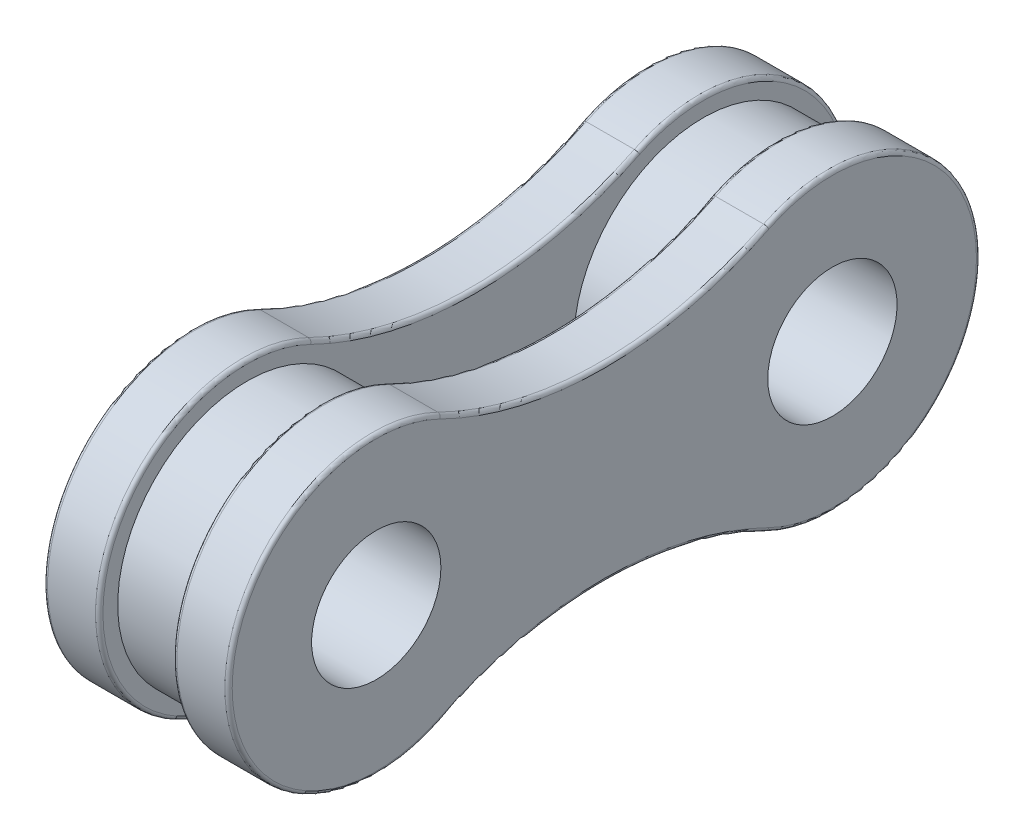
ISO-10303-21;
HEADER;
FILE_DESCRIPTION(('STEP AP214'),'2;1');
FILE_NAME('part.step','',(''),(''),'','','');
FILE_SCHEMA(('AUTOMOTIVE_DESIGN { 1 0 10303 214 1 1 1 1 }'));
ENDSEC;
DATA;
#1=APPLICATION_CONTEXT('core data for automotive mechanical design processes');
#2=APPLICATION_PROTOCOL_DEFINITION('international standard','automotive_design',2000,#1);
#3=PRODUCT_CONTEXT('',#1,'mechanical');
#4=PRODUCT('Part','Part','',(#3));
#5=PRODUCT_RELATED_PRODUCT_CATEGORY('part','',(#4));
#6=PRODUCT_DEFINITION_FORMATION('','',#4);
#7=PRODUCT_DEFINITION_CONTEXT('part definition',#1,'design');
#8=PRODUCT_DEFINITION('design','',#6,#7);
#9=PRODUCT_DEFINITION_SHAPE('','',#8);
#10=(LENGTH_UNIT() NAMED_UNIT(*) SI_UNIT(.MILLI.,.METRE.));
#11=(NAMED_UNIT(*) PLANE_ANGLE_UNIT() SI_UNIT($,.RADIAN.));
#12=(NAMED_UNIT(*) SI_UNIT($,.STERADIAN.) SOLID_ANGLE_UNIT());
#13=UNCERTAINTY_MEASURE_WITH_UNIT(LENGTH_MEASURE(1.E-05),#10,'distance_accuracy_value','');
#14=(GEOMETRIC_REPRESENTATION_CONTEXT(3) GLOBAL_UNCERTAINTY_ASSIGNED_CONTEXT((#13)) GLOBAL_UNIT_ASSIGNED_CONTEXT((#10,
#11,#12)) REPRESENTATION_CONTEXT('',''));
#15=CARTESIAN_POINT('',(0.,0.,0.));
#16=DIRECTION('',(0.,0.,1.));
#17=DIRECTION('',(1.,0.,0.));
#18=AXIS2_PLACEMENT_3D('',#15,#16,#17);
#19=CARTESIAN_POINT('',(1.,6.2823040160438,-3.0875));
#20=DIRECTION('',(1.,0.,0.));
#21=DIRECTION('',(0.,0.,-1.));
#22=AXIS2_PLACEMENT_3D('',#19,#20,#21);
#23=PLANE('',#22);
#24=CARTESIAN_POINT('',(1.,12.5646080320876,0.));
#25=DIRECTION('',(1.,0.,0.));
#26=DIRECTION('',(0.,0.,-1.));
#27=AXIS2_PLACEMENT_3D('',#24,#25,#26);
#28=CIRCLE('',#27,10.1);
#29=CARTESIAN_POINT('',(1.,3.50014080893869,4.45482142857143));
#30=VERTEX_POINT('',#29);
#31=CARTESIAN_POINT('',(1.,3.50014080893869,-4.45482142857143));
#32=VERTEX_POINT('',#31);
#33=EDGE_CURVE('E197',#30,#32,#28,.T.);
#34=ORIENTED_EDGE('',*,*,#33,.T.);
#35=CARTESIAN_POINT('',(1.,0.,-6.175));
#36=DIRECTION('',(1.,0.,0.));
#37=DIRECTION('',(0.,0.,-1.));
#38=AXIS2_PLACEMENT_3D('',#35,#36,#37);
#39=CIRCLE('',#38,3.9);
#40=CARTESIAN_POINT('',(1.,-3.50014080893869,-4.45482142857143));
#41=VERTEX_POINT('',#40);
#42=EDGE_CURVE('E203',#32,#41,#39,.F.);
#43=ORIENTED_EDGE('',*,*,#42,.T.);
#44=CARTESIAN_POINT('',(1.,-12.5646080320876,0.));
#45=DIRECTION('',(1.,0.,0.));
#46=DIRECTION('',(0.,0.,-1.));
#47=AXIS2_PLACEMENT_3D('',#44,#45,#46);
#48=CIRCLE('',#47,10.1);
#49=CARTESIAN_POINT('',(1.,-3.50014080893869,4.45482142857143));
#50=VERTEX_POINT('',#49);
#51=EDGE_CURVE('E201',#41,#50,#48,.T.);
#52=ORIENTED_EDGE('',*,*,#51,.T.);
#53=CARTESIAN_POINT('',(1.,0.,6.175));
#54=DIRECTION('',(1.,0.,0.));
#55=DIRECTION('',(0.,0.,-1.));
#56=AXIS2_PLACEMENT_3D('',#53,#54,#55);
#57=CIRCLE('',#56,3.9);
#58=EDGE_CURVE('E199',#50,#30,#57,.F.);
#59=ORIENTED_EDGE('',*,*,#58,.T.);
#60=EDGE_LOOP('',(#34,#43,#52,#59));
#61=FACE_BOUND('',#60,.T.);
#62=CARTESIAN_POINT('',(1.,0.,6.175));
#63=DIRECTION('',(1.,0.,0.));
#64=DIRECTION('',(0.,0.,-1.));
#65=AXIS2_PLACEMENT_3D('',#62,#63,#64);
#66=CIRCLE('',#65,3.5);
#67=CARTESIAN_POINT('',(1.,0.,2.675));
#68=VERTEX_POINT('',#67);
#69=EDGE_CURVE('E331',#68,#68,#66,.F.);
#70=ORIENTED_EDGE('',*,*,#69,.F.);
#71=EDGE_LOOP('',(#70));
#72=FACE_BOUND('',#71,.T.);
#73=CARTESIAN_POINT('',(1.,0.,-6.175));
#74=DIRECTION('',(1.,0.,0.));
#75=DIRECTION('',(0.,0.,-1.));
#76=AXIS2_PLACEMENT_3D('',#73,#74,#75);
#77=CIRCLE('',#76,3.5);
#78=CARTESIAN_POINT('',(1.,0.,-9.675));
#79=VERTEX_POINT('',#78);
#80=EDGE_CURVE('E174',#79,#79,#77,.F.);
#81=ORIENTED_EDGE('',*,*,#80,.F.);
#82=EDGE_LOOP('',(#81));
#83=FACE_BOUND('',#82,.T.);
#84=ADVANCED_FACE('F37',(#61,#72,#83),#23,.F.);
#85=CARTESIAN_POINT('',(-1.,6.2823040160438,-3.0875));
#86=DIRECTION('',(1.,0.,0.));
#87=DIRECTION('',(0.,0.,-1.));
#88=AXIS2_PLACEMENT_3D('',#85,#86,#87);
#89=PLANE('',#88);
#90=CARTESIAN_POINT('',(-1.,-12.5646080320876,0.));
#91=DIRECTION('',(1.,0.,0.));
#92=DIRECTION('',(0.,0.,-1.));
#93=AXIS2_PLACEMENT_3D('',#90,#91,#92);
#94=CIRCLE('',#93,10.1);
#95=CARTESIAN_POINT('',(-1.,-3.50014080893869,4.45482142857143));
#96=VERTEX_POINT('',#95);
#97=CARTESIAN_POINT('',(-1.,-3.50014080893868,-4.45482142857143));
#98=VERTEX_POINT('',#97);
#99=EDGE_CURVE('E210',#96,#98,#94,.F.);
#100=ORIENTED_EDGE('',*,*,#99,.T.);
#101=CARTESIAN_POINT('',(-1.,0.,-6.175));
#102=DIRECTION('',(1.,0.,0.));
#103=DIRECTION('',(0.,0.,-1.));
#104=AXIS2_PLACEMENT_3D('',#101,#102,#103);
#105=CIRCLE('',#104,3.9);
#106=CARTESIAN_POINT('',(-1.,3.50014080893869,-4.45482142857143));
#107=VERTEX_POINT('',#106);
#108=EDGE_CURVE('E212',#98,#107,#105,.T.);
#109=ORIENTED_EDGE('',*,*,#108,.T.);
#110=CARTESIAN_POINT('',(-1.,12.5646080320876,0.));
#111=DIRECTION('',(1.,0.,0.));
#112=DIRECTION('',(0.,0.,-1.));
#113=AXIS2_PLACEMENT_3D('',#110,#111,#112);
#114=CIRCLE('',#113,10.1);
#115=CARTESIAN_POINT('',(-1.,3.50014080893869,4.45482142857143));
#116=VERTEX_POINT('',#115);
#117=EDGE_CURVE('E206',#107,#116,#114,.F.);
#118=ORIENTED_EDGE('',*,*,#117,.T.);
#119=CARTESIAN_POINT('',(-1.,0.,6.175));
#120=DIRECTION('',(1.,0.,0.));
#121=DIRECTION('',(0.,0.,-1.));
#122=AXIS2_PLACEMENT_3D('',#119,#120,#121);
#123=CIRCLE('',#122,3.9);
#124=EDGE_CURVE('E208',#116,#96,#123,.T.);
#125=ORIENTED_EDGE('',*,*,#124,.T.);
#126=EDGE_LOOP('',(#100,#109,#118,#125));
#127=FACE_BOUND('',#126,.T.);
#128=CARTESIAN_POINT('',(-1.,0.,6.175));
#129=DIRECTION('',(1.,0.,0.));
#130=DIRECTION('',(0.,0.,-1.));
#131=AXIS2_PLACEMENT_3D('',#128,#129,#130);
#132=CIRCLE('',#131,3.5);
#133=CARTESIAN_POINT('',(-1.,0.,2.675));
#134=VERTEX_POINT('',#133);
#135=EDGE_CURVE('E310',#134,#134,#132,.T.);
#136=ORIENTED_EDGE('',*,*,#135,.F.);
#137=EDGE_LOOP('',(#136));
#138=FACE_BOUND('',#137,.T.);
#139=CARTESIAN_POINT('',(-1.,0.,-6.175));
#140=DIRECTION('',(1.,0.,0.));
#141=DIRECTION('',(0.,0.,-1.));
#142=AXIS2_PLACEMENT_3D('',#139,#140,#141);
#143=CIRCLE('',#142,3.5);
#144=CARTESIAN_POINT('',(-1.,0.,-9.675));
#145=VERTEX_POINT('',#144);
#146=EDGE_CURVE('E246',#145,#145,#143,.T.);
#147=ORIENTED_EDGE('',*,*,#146,.F.);
#148=EDGE_LOOP('',(#147));
#149=FACE_BOUND('',#148,.T.);
#150=ADVANCED_FACE('F377',(#127,#138,#149),#89,.T.);
#151=CARTESIAN_POINT('',(2.5,6.2823040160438,-3.0875));
#152=DIRECTION('',(1.,0.,0.));
#153=DIRECTION('',(0.,0.,-1.));
#154=AXIS2_PLACEMENT_3D('',#151,#152,#153);
#155=PLANE('',#154);
#156=CARTESIAN_POINT('',(2.5,-12.5646080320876,0.));
#157=DIRECTION('',(1.,0.,0.));
#158=DIRECTION('',(0.,0.,-1.));
#159=AXIS2_PLACEMENT_3D('',#156,#157,#158);
#160=CIRCLE('',#159,10.1);
#161=CARTESIAN_POINT('',(2.5,-3.50014080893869,4.45482142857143));
#162=VERTEX_POINT('',#161);
#163=CARTESIAN_POINT('',(2.5,-3.50014080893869,-4.45482142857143));
#164=VERTEX_POINT('',#163);
#165=EDGE_CURVE('E179',#162,#164,#160,.F.);
#166=ORIENTED_EDGE('',*,*,#165,.T.);
#167=CARTESIAN_POINT('',(2.5,0.,-6.175));
#168=DIRECTION('',(1.,0.,0.));
#169=DIRECTION('',(0.,0.,-1.));
#170=AXIS2_PLACEMENT_3D('',#167,#168,#169);
#171=CIRCLE('',#170,3.9);
#172=CARTESIAN_POINT('',(2.5,3.50014080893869,-4.45482142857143));
#173=VERTEX_POINT('',#172);
#174=EDGE_CURVE('E158',#164,#173,#171,.T.);
#175=ORIENTED_EDGE('',*,*,#174,.T.);
#176=CARTESIAN_POINT('',(2.5,12.5646080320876,0.));
#177=DIRECTION('',(1.,0.,0.));
#178=DIRECTION('',(0.,0.,-1.));
#179=AXIS2_PLACEMENT_3D('',#176,#177,#178);
#180=CIRCLE('',#179,10.1);
#181=CARTESIAN_POINT('',(2.5,3.50014080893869,4.45482142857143));
#182=VERTEX_POINT('',#181);
#183=EDGE_CURVE('E167',#173,#182,#180,.F.);
#184=ORIENTED_EDGE('',*,*,#183,.T.);
#185=CARTESIAN_POINT('',(2.5,0.,6.175));
#186=DIRECTION('',(1.,0.,0.));
#187=DIRECTION('',(0.,0.,-1.));
#188=AXIS2_PLACEMENT_3D('',#185,#186,#187);
#189=CIRCLE('',#188,3.9);
#190=EDGE_CURVE('E173',#182,#162,#189,.T.);
#191=ORIENTED_EDGE('',*,*,#190,.T.);
#192=EDGE_LOOP('',(#166,#175,#184,#191));
#193=FACE_BOUND('',#192,.T.);
#194=CARTESIAN_POINT('',(2.5,0.,6.175));
#195=DIRECTION('',(1.,0.,0.));
#196=DIRECTION('',(0.,0.,-1.));
#197=AXIS2_PLACEMENT_3D('',#194,#195,#196);
#198=CIRCLE('',#197,1.75);
#199=CARTESIAN_POINT('',(2.5,0.,4.425));
#200=VERTEX_POINT('',#199);
#201=EDGE_CURVE('E316',#200,#200,#198,.T.);
#202=ORIENTED_EDGE('',*,*,#201,.F.);
#203=EDGE_LOOP('',(#202));
#204=FACE_BOUND('',#203,.T.);
#205=CARTESIAN_POINT('',(2.5,0.,-6.175));
#206=DIRECTION('',(1.,0.,0.));
#207=DIRECTION('',(0.,0.,1.));
#208=AXIS2_PLACEMENT_3D('',#205,#206,#207);
#209=CIRCLE('',#208,1.75);
#210=CARTESIAN_POINT('',(2.5,0.,-4.425));
#211=VERTEX_POINT('',#210);
#212=EDGE_CURVE('E313',#211,#211,#209,.T.);
#213=ORIENTED_EDGE('',*,*,#212,.F.);
#214=EDGE_LOOP('',(#213));
#215=FACE_BOUND('',#214,.T.);
#216=ADVANCED_FACE('F176',(#193,#204,#215),#155,.T.);
#217=CARTESIAN_POINT('',(2.5,12.5646080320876,0.));
#218=DIRECTION('',(-1.,0.,0.));
#219=DIRECTION('',(0.,0.,1.));
#220=AXIS2_PLACEMENT_3D('',#217,#218,#219);
#221=CYLINDRICAL_SURFACE('',#220,10.);
#222=DIRECTION('',(-1.,0.,0.));
#223=VECTOR('',#222,1.);
#224=CARTESIAN_POINT('',(2.5,3.58988800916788,4.41071428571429));
#225=LINE('',#224,#223);
#226=CARTESIAN_POINT('',(2.4,3.58988800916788,4.41071428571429));
#227=VERTEX_POINT('',#226);
#228=CARTESIAN_POINT('',(1.1,3.58988800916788,4.41071428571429));
#229=VERTEX_POINT('',#228);
#230=EDGE_CURVE('E328',#227,#229,#225,.T.);
#231=ORIENTED_EDGE('',*,*,#230,.F.);
#232=CARTESIAN_POINT('',(2.4,12.5646080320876,0.));
#233=DIRECTION('',(1.,0.,0.));
#234=DIRECTION('',(0.,0.,-1.));
#235=AXIS2_PLACEMENT_3D('',#232,#233,#234);
#236=CIRCLE('',#235,10.);
#237=CARTESIAN_POINT('',(2.4,3.58988800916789,-4.41071428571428));
#238=VERTEX_POINT('',#237);
#239=EDGE_CURVE('E238',#227,#238,#236,.T.);
#240=ORIENTED_EDGE('',*,*,#239,.T.);
#241=DIRECTION('',(-1.,0.,0.));
#242=VECTOR('',#241,1.);
#243=CARTESIAN_POINT('',(2.5,3.58988800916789,-4.41071428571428));
#244=LINE('',#243,#242);
#245=CARTESIAN_POINT('',(1.1,3.58988800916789,-4.41071428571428));
#246=VERTEX_POINT('',#245);
#247=EDGE_CURVE('E319',#238,#246,#244,.T.);
#248=ORIENTED_EDGE('',*,*,#247,.T.);
#249=CARTESIAN_POINT('',(1.1,12.5646080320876,0.));
#250=DIRECTION('',(1.,0.,0.));
#251=DIRECTION('',(0.,0.,-1.));
#252=AXIS2_PLACEMENT_3D('',#249,#250,#251);
#253=CIRCLE('',#252,10.);
#254=EDGE_CURVE('E236',#246,#229,#253,.F.);
#255=ORIENTED_EDGE('',*,*,#254,.T.);
#256=EDGE_LOOP('',(#231,#240,#248,#255));
#257=FACE_BOUND('',#256,.T.);
#258=ADVANCED_FACE('F363',(#257),#221,.F.);
#259=CARTESIAN_POINT('',(2.5,0.,6.175));
#260=DIRECTION('',(-1.,0.,0.));
#261=DIRECTION('',(0.,0.,1.));
#262=AXIS2_PLACEMENT_3D('',#259,#260,#261);
#263=CYLINDRICAL_SURFACE('',#262,4.);
#264=DIRECTION('',(-1.,0.,0.));
#265=VECTOR('',#264,1.);
#266=CARTESIAN_POINT('',(2.5,-3.58988800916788,4.41071428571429));
#267=LINE('',#266,#265);
#268=CARTESIAN_POINT('',(2.4,-3.58988800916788,4.41071428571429));
#269=VERTEX_POINT('',#268);
#270=CARTESIAN_POINT('',(1.1,-3.58988800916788,4.41071428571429));
#271=VERTEX_POINT('',#270);
#272=EDGE_CURVE('E325',#269,#271,#267,.T.);
#273=ORIENTED_EDGE('',*,*,#272,.F.);
#274=CARTESIAN_POINT('',(2.4,0.,6.175));
#275=DIRECTION('',(1.,0.,0.));
#276=DIRECTION('',(0.,0.,-1.));
#277=AXIS2_PLACEMENT_3D('',#274,#275,#276);
#278=CIRCLE('',#277,4.);
#279=EDGE_CURVE('E195',#269,#227,#278,.F.);
#280=ORIENTED_EDGE('',*,*,#279,.T.);
#281=ORIENTED_EDGE('',*,*,#230,.T.);
#282=CARTESIAN_POINT('',(1.1,0.,6.175));
#283=DIRECTION('',(1.,0.,0.));
#284=DIRECTION('',(0.,0.,-1.));
#285=AXIS2_PLACEMENT_3D('',#282,#283,#284);
#286=CIRCLE('',#285,4.);
#287=EDGE_CURVE('E193',#229,#271,#286,.T.);
#288=ORIENTED_EDGE('',*,*,#287,.T.);
#289=EDGE_LOOP('',(#273,#280,#281,#288));
#290=FACE_BOUND('',#289,.T.);
#291=ADVANCED_FACE('F366',(#290),#263,.T.);
#292=CARTESIAN_POINT('',(2.5,-12.5646080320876,0.));
#293=DIRECTION('',(-1.,0.,0.));
#294=DIRECTION('',(0.,0.,1.));
#295=AXIS2_PLACEMENT_3D('',#292,#293,#294);
#296=CYLINDRICAL_SURFACE('',#295,10.);
#297=DIRECTION('',(-1.,0.,0.));
#298=VECTOR('',#297,1.);
#299=CARTESIAN_POINT('',(2.5,-3.58988800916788,-4.41071428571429));
#300=LINE('',#299,#298);
#301=CARTESIAN_POINT('',(2.4,-3.58988800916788,-4.41071428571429));
#302=VERTEX_POINT('',#301);
#303=CARTESIAN_POINT('',(1.1,-3.58988800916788,-4.41071428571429));
#304=VERTEX_POINT('',#303);
#305=EDGE_CURVE('E322',#302,#304,#300,.T.);
#306=ORIENTED_EDGE('',*,*,#305,.F.);
#307=CARTESIAN_POINT('',(2.4,-12.5646080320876,0.));
#308=DIRECTION('',(1.,0.,0.));
#309=DIRECTION('',(0.,0.,-1.));
#310=AXIS2_PLACEMENT_3D('',#307,#308,#309);
#311=CIRCLE('',#310,10.);
#312=EDGE_CURVE('E191',#302,#269,#311,.T.);
#313=ORIENTED_EDGE('',*,*,#312,.T.);
#314=ORIENTED_EDGE('',*,*,#272,.T.);
#315=CARTESIAN_POINT('',(1.1,-12.5646080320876,0.));
#316=DIRECTION('',(1.,0.,0.));
#317=DIRECTION('',(0.,0.,-1.));
#318=AXIS2_PLACEMENT_3D('',#315,#316,#317);
#319=CIRCLE('',#318,10.);
#320=EDGE_CURVE('E189',#271,#304,#319,.F.);
#321=ORIENTED_EDGE('',*,*,#320,.T.);
#322=EDGE_LOOP('',(#306,#313,#314,#321));
#323=FACE_BOUND('',#322,.T.);
#324=ADVANCED_FACE('F349',(#323),#296,.F.);
#325=CARTESIAN_POINT('',(2.5,0.,-6.175));
#326=DIRECTION('',(-1.,0.,0.));
#327=DIRECTION('',(0.,0.,1.));
#328=AXIS2_PLACEMENT_3D('',#325,#326,#327);
#329=CYLINDRICAL_SURFACE('',#328,4.);
#330=ORIENTED_EDGE('',*,*,#247,.F.);
#331=CARTESIAN_POINT('',(2.4,0.,-6.175));
#332=DIRECTION('',(1.,0.,0.));
#333=DIRECTION('',(0.,0.,-1.));
#334=AXIS2_PLACEMENT_3D('',#331,#332,#333);
#335=CIRCLE('',#334,4.);
#336=EDGE_CURVE('E160',#238,#302,#335,.F.);
#337=ORIENTED_EDGE('',*,*,#336,.T.);
#338=ORIENTED_EDGE('',*,*,#305,.T.);
#339=CARTESIAN_POINT('',(1.1,0.,-6.175));
#340=DIRECTION('',(1.,0.,0.));
#341=DIRECTION('',(0.,0.,-1.));
#342=AXIS2_PLACEMENT_3D('',#339,#340,#341);
#343=CIRCLE('',#342,4.);
#344=EDGE_CURVE('E181',#304,#246,#343,.T.);
#345=ORIENTED_EDGE('',*,*,#344,.T.);
#346=EDGE_LOOP('',(#330,#337,#338,#345));
#347=FACE_BOUND('',#346,.T.);
#348=ADVANCED_FACE('F347',(#347),#329,.T.);
#349=CARTESIAN_POINT('',(2.5,0.,6.175));
#350=DIRECTION('',(-1.,0.,0.));
#351=DIRECTION('',(0.,0.,1.));
#352=AXIS2_PLACEMENT_3D('',#349,#350,#351);
#353=CYLINDRICAL_SURFACE('',#352,1.75);
#354=ORIENTED_EDGE('',*,*,#201,.T.);
#355=EDGE_LOOP('',(#354));
#356=FACE_BOUND('',#355,.T.);
#357=CARTESIAN_POINT('',(-2.5,0.,6.175));
#358=DIRECTION('',(1.,0.,0.));
#359=DIRECTION('',(0.,0.,-1.));
#360=AXIS2_PLACEMENT_3D('',#357,#358,#359);
#361=CIRCLE('',#360,1.75);
#362=CARTESIAN_POINT('',(-2.5,0.,4.425));
#363=VERTEX_POINT('',#362);
#364=EDGE_CURVE('E306',#363,#363,#361,.T.);
#365=ORIENTED_EDGE('',*,*,#364,.F.);
#366=EDGE_LOOP('',(#365));
#367=FACE_BOUND('',#366,.T.);
#368=ADVANCED_FACE('F440',(#356,#367),#353,.F.);
#369=CARTESIAN_POINT('',(2.5,0.,-6.175));
#370=DIRECTION('',(-1.,0.,0.));
#371=DIRECTION('',(0.,0.,1.));
#372=AXIS2_PLACEMENT_3D('',#369,#370,#371);
#373=CYLINDRICAL_SURFACE('',#372,1.75);
#374=ORIENTED_EDGE('',*,*,#212,.T.);
#375=EDGE_LOOP('',(#374));
#376=FACE_BOUND('',#375,.T.);
#377=CARTESIAN_POINT('',(-2.5,0.,-6.175));
#378=DIRECTION('',(1.,0.,0.));
#379=DIRECTION('',(0.,0.,-1.));
#380=AXIS2_PLACEMENT_3D('',#377,#378,#379);
#381=CIRCLE('',#380,1.75);
#382=CARTESIAN_POINT('',(-2.5,0.,-7.925));
#383=VERTEX_POINT('',#382);
#384=EDGE_CURVE('E301',#383,#383,#381,.T.);
#385=ORIENTED_EDGE('',*,*,#384,.F.);
#386=EDGE_LOOP('',(#385));
#387=FACE_BOUND('',#386,.T.);
#388=ADVANCED_FACE('F436',(#376,#387),#373,.F.);
#389=CARTESIAN_POINT('',(1.,0.,6.175));
#390=DIRECTION('',(-1.,0.,0.));
#391=DIRECTION('',(0.,0.,1.));
#392=AXIS2_PLACEMENT_3D('',#389,#390,#391);
#393=CYLINDRICAL_SURFACE('',#392,3.5);
#394=ORIENTED_EDGE('',*,*,#69,.T.);
#395=EDGE_LOOP('',(#394));
#396=FACE_BOUND('',#395,.T.);
#397=ORIENTED_EDGE('',*,*,#135,.T.);
#398=EDGE_LOOP('',(#397));
#399=FACE_BOUND('',#398,.T.);
#400=ADVANCED_FACE('F427',(#396,#399),#393,.T.);
#401=CARTESIAN_POINT('',(-2.5,0.,-6.175));
#402=DIRECTION('',(1.,0.,0.));
#403=DIRECTION('',(0.,0.,-1.));
#404=AXIS2_PLACEMENT_3D('',#401,#402,#403);
#405=CYLINDRICAL_SURFACE('',#404,4.);
#406=DIRECTION('',(1.,0.,0.));
#407=VECTOR('',#406,1.);
#408=CARTESIAN_POINT('',(-2.5,3.58988800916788,-4.41071428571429));
#409=LINE('',#408,#407);
#410=CARTESIAN_POINT('',(-2.4,3.58988800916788,-4.41071428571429));
#411=VERTEX_POINT('',#410);
#412=CARTESIAN_POINT('',(-1.1,3.58988800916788,-4.41071428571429));
#413=VERTEX_POINT('',#412);
#414=EDGE_CURVE('E294',#411,#413,#409,.T.);
#415=ORIENTED_EDGE('',*,*,#414,.T.);
#416=CARTESIAN_POINT('',(-1.1,0.,-6.175));
#417=DIRECTION('',(1.,0.,0.));
#418=DIRECTION('',(0.,0.,-1.));
#419=AXIS2_PLACEMENT_3D('',#416,#417,#418);
#420=CIRCLE('',#419,4.);
#421=CARTESIAN_POINT('',(-1.1,-3.58988800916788,-4.41071428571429));
#422=VERTEX_POINT('',#421);
#423=EDGE_CURVE('E218',#413,#422,#420,.F.);
#424=ORIENTED_EDGE('',*,*,#423,.T.);
#425=DIRECTION('',(1.,0.,0.));
#426=VECTOR('',#425,1.);
#427=CARTESIAN_POINT('',(-2.5,-3.58988800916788,-4.41071428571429));
#428=LINE('',#427,#426);
#429=CARTESIAN_POINT('',(-2.4,-3.58988800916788,-4.41071428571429));
#430=VERTEX_POINT('',#429);
#431=EDGE_CURVE('E297',#430,#422,#428,.T.);
#432=ORIENTED_EDGE('',*,*,#431,.F.);
#433=CARTESIAN_POINT('',(-2.4,0.,-6.175));
#434=DIRECTION('',(1.,0.,0.));
#435=DIRECTION('',(0.,0.,-1.));
#436=AXIS2_PLACEMENT_3D('',#433,#434,#435);
#437=CIRCLE('',#436,4.);
#438=EDGE_CURVE('E215',#430,#411,#437,.T.);
#439=ORIENTED_EDGE('',*,*,#438,.T.);
#440=EDGE_LOOP('',(#415,#424,#432,#439));
#441=FACE_BOUND('',#440,.T.);
#442=ADVANCED_FACE('F293',(#441),#405,.T.);
#443=CARTESIAN_POINT('',(-2.5,-12.5646080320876,0.));
#444=DIRECTION('',(1.,0.,0.));
#445=DIRECTION('',(0.,0.,-1.));
#446=AXIS2_PLACEMENT_3D('',#443,#444,#445);
#447=CYLINDRICAL_SURFACE('',#446,10.);
#448=ORIENTED_EDGE('',*,*,#431,.T.);
#449=CARTESIAN_POINT('',(-1.1,-12.5646080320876,0.));
#450=DIRECTION('',(1.,0.,0.));
#451=DIRECTION('',(0.,0.,-1.));
#452=AXIS2_PLACEMENT_3D('',#449,#450,#451);
#453=CIRCLE('',#452,10.);
#454=CARTESIAN_POINT('',(-1.1,-3.58988800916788,4.41071428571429));
#455=VERTEX_POINT('',#454);
#456=EDGE_CURVE('E223',#422,#455,#453,.T.);
#457=ORIENTED_EDGE('',*,*,#456,.T.);
#458=DIRECTION('',(1.,0.,0.));
#459=VECTOR('',#458,1.);
#460=CARTESIAN_POINT('',(-2.5,-3.58988800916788,4.41071428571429));
#461=LINE('',#460,#459);
#462=CARTESIAN_POINT('',(-2.4,-3.58988800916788,4.41071428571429));
#463=VERTEX_POINT('',#462);
#464=EDGE_CURVE('E303',#463,#455,#461,.T.);
#465=ORIENTED_EDGE('',*,*,#464,.F.);
#466=CARTESIAN_POINT('',(-2.4,-12.5646080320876,0.));
#467=DIRECTION('',(1.,0.,0.));
#468=DIRECTION('',(0.,0.,-1.));
#469=AXIS2_PLACEMENT_3D('',#466,#467,#468);
#470=CIRCLE('',#469,10.);
#471=EDGE_CURVE('E221',#463,#430,#470,.F.);
#472=ORIENTED_EDGE('',*,*,#471,.T.);
#473=EDGE_LOOP('',(#448,#457,#465,#472));
#474=FACE_BOUND('',#473,.T.);
#475=ADVANCED_FACE('F419',(#474),#447,.F.);
#476=CARTESIAN_POINT('',(-2.5,0.,6.175));
#477=DIRECTION('',(1.,0.,0.));
#478=DIRECTION('',(0.,0.,-1.));
#479=AXIS2_PLACEMENT_3D('',#476,#477,#478);
#480=CYLINDRICAL_SURFACE('',#479,4.);
#481=ORIENTED_EDGE('',*,*,#464,.T.);
#482=CARTESIAN_POINT('',(-1.1,0.,6.175));
#483=DIRECTION('',(1.,0.,0.));
#484=DIRECTION('',(0.,0.,-1.));
#485=AXIS2_PLACEMENT_3D('',#482,#483,#484);
#486=CIRCLE('',#485,4.);
#487=CARTESIAN_POINT('',(-1.1,3.58988800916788,4.41071428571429));
#488=VERTEX_POINT('',#487);
#489=EDGE_CURVE('E227',#455,#488,#486,.F.);
#490=ORIENTED_EDGE('',*,*,#489,.T.);
#491=DIRECTION('',(1.,0.,0.));
#492=VECTOR('',#491,1.);
#493=CARTESIAN_POINT('',(-2.5,3.58988800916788,4.41071428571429));
#494=LINE('',#493,#492);
#495=CARTESIAN_POINT('',(-2.4,3.58988800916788,4.41071428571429));
#496=VERTEX_POINT('',#495);
#497=EDGE_CURVE('E300',#496,#488,#494,.T.);
#498=ORIENTED_EDGE('',*,*,#497,.F.);
#499=CARTESIAN_POINT('',(-2.4,0.,6.175));
#500=DIRECTION('',(1.,0.,0.));
#501=DIRECTION('',(0.,0.,-1.));
#502=AXIS2_PLACEMENT_3D('',#499,#500,#501);
#503=CIRCLE('',#502,4.);
#504=EDGE_CURVE('E225',#496,#463,#503,.T.);
#505=ORIENTED_EDGE('',*,*,#504,.T.);
#506=EDGE_LOOP('',(#481,#490,#498,#505));
#507=FACE_BOUND('',#506,.T.);
#508=ADVANCED_FACE('F398',(#507),#480,.T.);
#509=CARTESIAN_POINT('',(-2.5,12.5646080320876,0.));
#510=DIRECTION('',(1.,0.,0.));
#511=DIRECTION('',(0.,0.,-1.));
#512=AXIS2_PLACEMENT_3D('',#509,#510,#511);
#513=CYLINDRICAL_SURFACE('',#512,10.);
#514=ORIENTED_EDGE('',*,*,#497,.T.);
#515=CARTESIAN_POINT('',(-1.1,12.5646080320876,0.));
#516=DIRECTION('',(1.,0.,0.));
#517=DIRECTION('',(0.,0.,-1.));
#518=AXIS2_PLACEMENT_3D('',#515,#516,#517);
#519=CIRCLE('',#518,10.);
#520=EDGE_CURVE('E11',#488,#413,#519,.T.);
#521=ORIENTED_EDGE('',*,*,#520,.T.);
#522=ORIENTED_EDGE('',*,*,#414,.F.);
#523=CARTESIAN_POINT('',(-2.4,12.5646080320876,0.));
#524=DIRECTION('',(1.,0.,0.));
#525=DIRECTION('',(0.,0.,-1.));
#526=AXIS2_PLACEMENT_3D('',#523,#524,#525);
#527=CIRCLE('',#526,10.);
#528=EDGE_CURVE('E46',#411,#496,#527,.F.);
#529=ORIENTED_EDGE('',*,*,#528,.T.);
#530=EDGE_LOOP('',(#514,#521,#522,#529));
#531=FACE_BOUND('',#530,.T.);
#532=ADVANCED_FACE('F298',(#531),#513,.F.);
#533=CARTESIAN_POINT('',(-2.5,6.2823040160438,-3.0875));
#534=DIRECTION('',(1.,0.,0.));
#535=DIRECTION('',(0.,0.,-1.));
#536=AXIS2_PLACEMENT_3D('',#533,#534,#535);
#537=PLANE('',#536);
#538=CARTESIAN_POINT('',(-2.5,12.5646080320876,0.));
#539=DIRECTION('',(1.,0.,0.));
#540=DIRECTION('',(0.,0.,-1.));
#541=AXIS2_PLACEMENT_3D('',#538,#539,#540);
#542=CIRCLE('',#541,10.1);
#543=CARTESIAN_POINT('',(-2.5,3.50014080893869,4.45482142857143));
#544=VERTEX_POINT('',#543);
#545=CARTESIAN_POINT('',(-2.5,3.50014080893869,-4.45482142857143));
#546=VERTEX_POINT('',#545);
#547=EDGE_CURVE('E229',#544,#546,#542,.T.);
#548=ORIENTED_EDGE('',*,*,#547,.T.);
#549=CARTESIAN_POINT('',(-2.5,0.,-6.175));
#550=DIRECTION('',(1.,0.,0.));
#551=DIRECTION('',(0.,0.,-1.));
#552=AXIS2_PLACEMENT_3D('',#549,#550,#551);
#553=CIRCLE('',#552,3.9);
#554=CARTESIAN_POINT('',(-2.5,-3.50014080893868,-4.45482142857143));
#555=VERTEX_POINT('',#554);
#556=EDGE_CURVE('E234',#546,#555,#553,.F.);
#557=ORIENTED_EDGE('',*,*,#556,.T.);
#558=CARTESIAN_POINT('',(-2.5,-12.5646080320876,0.));
#559=DIRECTION('',(1.,0.,0.));
#560=DIRECTION('',(0.,0.,-1.));
#561=AXIS2_PLACEMENT_3D('',#558,#559,#560);
#562=CIRCLE('',#561,10.1);
#563=CARTESIAN_POINT('',(-2.5,-3.50014080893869,4.45482142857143));
#564=VERTEX_POINT('',#563);
#565=EDGE_CURVE('E61',#555,#564,#562,.T.);
#566=ORIENTED_EDGE('',*,*,#565,.T.);
#567=CARTESIAN_POINT('',(-2.5,0.,6.175));
#568=DIRECTION('',(1.,0.,0.));
#569=DIRECTION('',(0.,0.,-1.));
#570=AXIS2_PLACEMENT_3D('',#567,#568,#569);
#571=CIRCLE('',#570,3.9);
#572=EDGE_CURVE('E231',#564,#544,#571,.F.);
#573=ORIENTED_EDGE('',*,*,#572,.T.);
#574=EDGE_LOOP('',(#548,#557,#566,#573));
#575=FACE_BOUND('',#574,.T.);
#576=ORIENTED_EDGE('',*,*,#364,.T.);
#577=EDGE_LOOP('',(#576));
#578=FACE_BOUND('',#577,.T.);
#579=ORIENTED_EDGE('',*,*,#384,.T.);
#580=EDGE_LOOP('',(#579));
#581=FACE_BOUND('',#580,.T.);
#582=ADVANCED_FACE('F281',(#575,#578,#581),#537,.F.);
#583=CARTESIAN_POINT('',(1.,0.,-6.175));
#584=DIRECTION('',(-1.,0.,0.));
#585=DIRECTION('',(0.,0.,1.));
#586=AXIS2_PLACEMENT_3D('',#583,#584,#585);
#587=CYLINDRICAL_SURFACE('',#586,3.5);
#588=ORIENTED_EDGE('',*,*,#80,.T.);
#589=EDGE_LOOP('',(#588));
#590=FACE_BOUND('',#589,.T.);
#591=ORIENTED_EDGE('',*,*,#146,.T.);
#592=EDGE_LOOP('',(#591));
#593=FACE_BOUND('',#592,.T.);
#594=ADVANCED_FACE('F383',(#590,#593),#587,.T.);
#595=CARTESIAN_POINT('',(2.4,0.,6.175));
#596=DIRECTION('',(1.,0.,0.));
#597=DIRECTION('',(0.,0.,-1.));
#598=AXIS2_PLACEMENT_3D('',#595,#596,#597);
#599=TOROIDAL_SURFACE('',#598,3.9,0.1);
#600=CARTESIAN_POINT('',(2.4,3.50014080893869,4.45482142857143));
#601=DIRECTION('',(0.,-0.441071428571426,-0.897472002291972));
#602=DIRECTION('',(0.,0.897472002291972,-0.441071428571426));
#603=AXIS2_PLACEMENT_3D('',#600,#601,#602);
#604=CIRCLE('',#603,0.1);
#605=EDGE_CURVE('E170',#227,#182,#604,.T.);
#606=ORIENTED_EDGE('',*,*,#605,.F.);
#607=ORIENTED_EDGE('',*,*,#279,.F.);
#608=CARTESIAN_POINT('',(2.4,-3.50014080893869,4.45482142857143));
#609=DIRECTION('',(0.,0.441071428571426,-0.897472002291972));
#610=DIRECTION('',(0.,0.897472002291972,0.441071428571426));
#611=AXIS2_PLACEMENT_3D('',#608,#609,#610);
#612=CIRCLE('',#611,0.1);
#613=EDGE_CURVE('E243',#162,#269,#612,.T.);
#614=ORIENTED_EDGE('',*,*,#613,.F.);
#615=ORIENTED_EDGE('',*,*,#190,.F.);
#616=EDGE_LOOP('',(#606,#607,#614,#615));
#617=FACE_BOUND('',#616,.T.);
#618=ADVANCED_FACE('F338',(#617),#599,.T.);
#619=CARTESIAN_POINT('',(2.4,-12.5646080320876,0.));
#620=DIRECTION('',(1.,0.,0.));
#621=DIRECTION('',(0.,0.,-1.));
#622=AXIS2_PLACEMENT_3D('',#619,#620,#621);
#623=TOROIDAL_SURFACE('',#622,10.1,0.1);
#624=ORIENTED_EDGE('',*,*,#613,.T.);
#625=ORIENTED_EDGE('',*,*,#312,.F.);
#626=CARTESIAN_POINT('',(2.4,-3.50014080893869,-4.45482142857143));
#627=DIRECTION('',(0.,-0.441071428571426,-0.897472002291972));
#628=DIRECTION('',(0.,0.897472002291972,-0.441071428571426));
#629=AXIS2_PLACEMENT_3D('',#626,#627,#628);
#630=CIRCLE('',#629,0.1);
#631=EDGE_CURVE('E163',#164,#302,#630,.T.);
#632=ORIENTED_EDGE('',*,*,#631,.F.);
#633=ORIENTED_EDGE('',*,*,#165,.F.);
#634=EDGE_LOOP('',(#624,#625,#632,#633));
#635=FACE_BOUND('',#634,.T.);
#636=ADVANCED_FACE('F341',(#635),#623,.T.);
#637=CARTESIAN_POINT('',(2.4,12.5646080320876,0.));
#638=DIRECTION('',(1.,0.,0.));
#639=DIRECTION('',(0.,0.,-1.));
#640=AXIS2_PLACEMENT_3D('',#637,#638,#639);
#641=TOROIDAL_SURFACE('',#640,10.1,0.1);
#642=ORIENTED_EDGE('',*,*,#605,.T.);
#643=ORIENTED_EDGE('',*,*,#183,.F.);
#644=CARTESIAN_POINT('',(2.4,3.50014080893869,-4.45482142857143));
#645=DIRECTION('',(0.,0.441071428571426,-0.897472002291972));
#646=DIRECTION('',(0.,0.897472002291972,0.441071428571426));
#647=AXIS2_PLACEMENT_3D('',#644,#645,#646);
#648=CIRCLE('',#647,0.1);
#649=EDGE_CURVE('E154',#238,#173,#648,.T.);
#650=ORIENTED_EDGE('',*,*,#649,.F.);
#651=ORIENTED_EDGE('',*,*,#239,.F.);
#652=EDGE_LOOP('',(#642,#643,#650,#651));
#653=FACE_BOUND('',#652,.T.);
#654=ADVANCED_FACE('F168',(#653),#641,.T.);
#655=CARTESIAN_POINT('',(2.4,0.,-6.175));
#656=DIRECTION('',(1.,0.,0.));
#657=DIRECTION('',(0.,0.,-1.));
#658=AXIS2_PLACEMENT_3D('',#655,#656,#657);
#659=TOROIDAL_SURFACE('',#658,3.9,0.1);
#660=ORIENTED_EDGE('',*,*,#631,.T.);
#661=ORIENTED_EDGE('',*,*,#336,.F.);
#662=ORIENTED_EDGE('',*,*,#649,.T.);
#663=ORIENTED_EDGE('',*,*,#174,.F.);
#664=EDGE_LOOP('',(#660,#661,#662,#663));
#665=FACE_BOUND('',#664,.T.);
#666=ADVANCED_FACE('F156',(#665),#659,.T.);
#667=CARTESIAN_POINT('',(1.1,0.,6.175));
#668=DIRECTION('',(1.,0.,0.));
#669=DIRECTION('',(0.,0.,-1.));
#670=AXIS2_PLACEMENT_3D('',#667,#668,#669);
#671=TOROIDAL_SURFACE('',#670,3.9,0.1);
#672=CARTESIAN_POINT('',(1.1,3.50014080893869,4.45482142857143));
#673=DIRECTION('',(0.,-0.441071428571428,-0.897472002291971));
#674=DIRECTION('',(0.,0.897472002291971,-0.441071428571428));
#675=AXIS2_PLACEMENT_3D('',#672,#673,#674);
#676=CIRCLE('',#675,0.1);
#677=EDGE_CURVE('E252',#30,#229,#676,.T.);
#678=ORIENTED_EDGE('',*,*,#677,.F.);
#679=ORIENTED_EDGE('',*,*,#58,.F.);
#680=CARTESIAN_POINT('',(1.1,-3.50014080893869,4.45482142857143));
#681=DIRECTION('',(0.,0.441071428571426,-0.897472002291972));
#682=DIRECTION('',(0.,0.897472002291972,0.441071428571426));
#683=AXIS2_PLACEMENT_3D('',#680,#681,#682);
#684=CIRCLE('',#683,0.1);
#685=EDGE_CURVE('E164',#271,#50,#684,.T.);
#686=ORIENTED_EDGE('',*,*,#685,.F.);
#687=ORIENTED_EDGE('',*,*,#287,.F.);
#688=EDGE_LOOP('',(#678,#679,#686,#687));
#689=FACE_BOUND('',#688,.T.);
#690=ADVANCED_FACE('F369',(#689),#671,.T.);
#691=CARTESIAN_POINT('',(1.1,-12.5646080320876,0.));
#692=DIRECTION('',(1.,0.,0.));
#693=DIRECTION('',(0.,0.,-1.));
#694=AXIS2_PLACEMENT_3D('',#691,#692,#693);
#695=TOROIDAL_SURFACE('',#694,10.1,0.1);
#696=ORIENTED_EDGE('',*,*,#685,.T.);
#697=ORIENTED_EDGE('',*,*,#51,.F.);
#698=CARTESIAN_POINT('',(1.1,-3.50014080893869,-4.45482142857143));
#699=DIRECTION('',(0.,-0.441071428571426,-0.897472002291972));
#700=DIRECTION('',(0.,0.897472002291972,-0.441071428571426));
#701=AXIS2_PLACEMENT_3D('',#698,#699,#700);
#702=CIRCLE('',#701,0.1);
#703=EDGE_CURVE('E249',#304,#41,#702,.T.);
#704=ORIENTED_EDGE('',*,*,#703,.F.);
#705=ORIENTED_EDGE('',*,*,#320,.F.);
#706=EDGE_LOOP('',(#696,#697,#704,#705));
#707=FACE_BOUND('',#706,.T.);
#708=ADVANCED_FACE('F353',(#707),#695,.T.);
#709=CARTESIAN_POINT('',(1.1,12.5646080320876,0.));
#710=DIRECTION('',(1.,0.,0.));
#711=DIRECTION('',(0.,0.,-1.));
#712=AXIS2_PLACEMENT_3D('',#709,#710,#711);
#713=TOROIDAL_SURFACE('',#712,10.1,0.1);
#714=ORIENTED_EDGE('',*,*,#677,.T.);
#715=ORIENTED_EDGE('',*,*,#254,.F.);
#716=CARTESIAN_POINT('',(1.1,3.50014080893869,-4.45482142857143));
#717=DIRECTION('',(0.,0.441071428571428,-0.897472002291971));
#718=DIRECTION('',(0.,0.897472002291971,0.441071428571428));
#719=AXIS2_PLACEMENT_3D('',#716,#717,#718);
#720=CIRCLE('',#719,0.1);
#721=EDGE_CURVE('E247',#32,#246,#720,.T.);
#722=ORIENTED_EDGE('',*,*,#721,.F.);
#723=ORIENTED_EDGE('',*,*,#33,.F.);
#724=EDGE_LOOP('',(#714,#715,#722,#723));
#725=FACE_BOUND('',#724,.T.);
#726=ADVANCED_FACE('F373',(#725),#713,.T.);
#727=CARTESIAN_POINT('',(1.1,0.,-6.175));
#728=DIRECTION('',(1.,0.,0.));
#729=DIRECTION('',(0.,0.,-1.));
#730=AXIS2_PLACEMENT_3D('',#727,#728,#729);
#731=TOROIDAL_SURFACE('',#730,3.9,0.1);
#732=ORIENTED_EDGE('',*,*,#703,.T.);
#733=ORIENTED_EDGE('',*,*,#42,.F.);
#734=ORIENTED_EDGE('',*,*,#721,.T.);
#735=ORIENTED_EDGE('',*,*,#344,.F.);
#736=EDGE_LOOP('',(#732,#733,#734,#735));
#737=FACE_BOUND('',#736,.T.);
#738=ADVANCED_FACE('F358',(#737),#731,.T.);
#739=CARTESIAN_POINT('',(-1.1,0.,6.175));
#740=DIRECTION('',(1.,0.,0.));
#741=DIRECTION('',(0.,0.,-1.));
#742=AXIS2_PLACEMENT_3D('',#739,#740,#741);
#743=TOROIDAL_SURFACE('',#742,3.9,0.1);
#744=CARTESIAN_POINT('',(-1.1,3.50014080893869,4.45482142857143));
#745=DIRECTION('',(0.,-0.441071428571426,-0.897472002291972));
#746=DIRECTION('',(0.,0.897472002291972,-0.441071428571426));
#747=AXIS2_PLACEMENT_3D('',#744,#745,#746);
#748=CIRCLE('',#747,0.1);
#749=EDGE_CURVE('E261',#488,#116,#748,.T.);
#750=ORIENTED_EDGE('',*,*,#749,.F.);
#751=ORIENTED_EDGE('',*,*,#489,.F.);
#752=CARTESIAN_POINT('',(-1.1,-3.50014080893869,4.45482142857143));
#753=DIRECTION('',(0.,0.441071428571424,-0.897472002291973));
#754=DIRECTION('',(0.,0.897472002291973,0.441071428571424));
#755=AXIS2_PLACEMENT_3D('',#752,#753,#754);
#756=CIRCLE('',#755,0.1);
#757=EDGE_CURVE('E250',#96,#455,#756,.T.);
#758=ORIENTED_EDGE('',*,*,#757,.F.);
#759=ORIENTED_EDGE('',*,*,#124,.F.);
#760=EDGE_LOOP('',(#750,#751,#758,#759));
#761=FACE_BOUND('',#760,.T.);
#762=ADVANCED_FACE('F403',(#761),#743,.T.);
#763=CARTESIAN_POINT('',(-1.1,-12.5646080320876,0.));
#764=DIRECTION('',(1.,0.,0.));
#765=DIRECTION('',(0.,0.,-1.));
#766=AXIS2_PLACEMENT_3D('',#763,#764,#765);
#767=TOROIDAL_SURFACE('',#766,10.1,0.1);
#768=ORIENTED_EDGE('',*,*,#757,.T.);
#769=ORIENTED_EDGE('',*,*,#456,.F.);
#770=CARTESIAN_POINT('',(-1.1,-3.50014080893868,-4.45482142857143));
#771=DIRECTION('',(0.,-0.441071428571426,-0.897472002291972));
#772=DIRECTION('',(0.,0.897472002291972,-0.441071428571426));
#773=AXIS2_PLACEMENT_3D('',#770,#771,#772);
#774=CIRCLE('',#773,0.1);
#775=EDGE_CURVE('E259',#98,#422,#774,.T.);
#776=ORIENTED_EDGE('',*,*,#775,.F.);
#777=ORIENTED_EDGE('',*,*,#99,.F.);
#778=EDGE_LOOP('',(#768,#769,#776,#777));
#779=FACE_BOUND('',#778,.T.);
#780=ADVANCED_FACE('F408',(#779),#767,.T.);
#781=CARTESIAN_POINT('',(-1.1,12.5646080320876,0.));
#782=DIRECTION('',(1.,0.,0.));
#783=DIRECTION('',(0.,0.,-1.));
#784=AXIS2_PLACEMENT_3D('',#781,#782,#783);
#785=TOROIDAL_SURFACE('',#784,10.1,0.1);
#786=ORIENTED_EDGE('',*,*,#749,.T.);
#787=ORIENTED_EDGE('',*,*,#117,.F.);
#788=CARTESIAN_POINT('',(-1.1,3.50014080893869,-4.45482142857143));
#789=DIRECTION('',(0.,0.441071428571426,-0.897472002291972));
#790=DIRECTION('',(0.,0.897472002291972,0.441071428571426));
#791=AXIS2_PLACEMENT_3D('',#788,#789,#790);
#792=CIRCLE('',#791,0.1);
#793=EDGE_CURVE('E257',#413,#107,#792,.T.);
#794=ORIENTED_EDGE('',*,*,#793,.F.);
#795=ORIENTED_EDGE('',*,*,#520,.F.);
#796=EDGE_LOOP('',(#786,#787,#794,#795));
#797=FACE_BOUND('',#796,.T.);
#798=ADVANCED_FACE('F415',(#797),#785,.T.);
#799=CARTESIAN_POINT('',(-1.1,0.,-6.175));
#800=DIRECTION('',(1.,0.,0.));
#801=DIRECTION('',(0.,0.,-1.));
#802=AXIS2_PLACEMENT_3D('',#799,#800,#801);
#803=TOROIDAL_SURFACE('',#802,3.9,0.1);
#804=ORIENTED_EDGE('',*,*,#775,.T.);
#805=ORIENTED_EDGE('',*,*,#423,.F.);
#806=ORIENTED_EDGE('',*,*,#793,.T.);
#807=ORIENTED_EDGE('',*,*,#108,.F.);
#808=EDGE_LOOP('',(#804,#805,#806,#807));
#809=FACE_BOUND('',#808,.T.);
#810=ADVANCED_FACE('F418',(#809),#803,.T.);
#811=CARTESIAN_POINT('',(-2.4,0.,6.175));
#812=DIRECTION('',(1.,0.,0.));
#813=DIRECTION('',(0.,0.,-1.));
#814=AXIS2_PLACEMENT_3D('',#811,#812,#813);
#815=TOROIDAL_SURFACE('',#814,3.9,0.1);
#816=CARTESIAN_POINT('',(-2.4,3.50014080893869,4.45482142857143));
#817=DIRECTION('',(0.,-0.441071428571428,-0.897472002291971));
#818=DIRECTION('',(0.,0.897472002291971,-0.441071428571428));
#819=AXIS2_PLACEMENT_3D('',#816,#817,#818);
#820=CIRCLE('',#819,0.1);
#821=EDGE_CURVE('E268',#544,#496,#820,.T.);
#822=ORIENTED_EDGE('',*,*,#821,.F.);
#823=ORIENTED_EDGE('',*,*,#572,.F.);
#824=CARTESIAN_POINT('',(-2.4,-3.50014080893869,4.45482142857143));
#825=DIRECTION('',(0.,0.441071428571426,-0.897472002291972));
#826=DIRECTION('',(0.,0.897472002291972,0.441071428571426));
#827=AXIS2_PLACEMENT_3D('',#824,#825,#826);
#828=CIRCLE('',#827,0.1);
#829=EDGE_CURVE('E41',#463,#564,#828,.T.);
#830=ORIENTED_EDGE('',*,*,#829,.F.);
#831=ORIENTED_EDGE('',*,*,#504,.F.);
#832=EDGE_LOOP('',(#822,#823,#830,#831));
#833=FACE_BOUND('',#832,.T.);
#834=ADVANCED_FACE('F39',(#833),#815,.T.);
#835=CARTESIAN_POINT('',(-2.4,-12.5646080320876,0.));
#836=DIRECTION('',(1.,0.,0.));
#837=DIRECTION('',(0.,0.,-1.));
#838=AXIS2_PLACEMENT_3D('',#835,#836,#837);
#839=TOROIDAL_SURFACE('',#838,10.1,0.1);
#840=ORIENTED_EDGE('',*,*,#829,.T.);
#841=ORIENTED_EDGE('',*,*,#565,.F.);
#842=CARTESIAN_POINT('',(-2.4,-3.50014080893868,-4.45482142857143));
#843=DIRECTION('',(0.,-0.441071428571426,-0.897472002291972));
#844=DIRECTION('',(0.,0.897472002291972,-0.441071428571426));
#845=AXIS2_PLACEMENT_3D('',#842,#843,#844);
#846=CIRCLE('',#845,0.1);
#847=EDGE_CURVE('E54',#430,#555,#846,.T.);
#848=ORIENTED_EDGE('',*,*,#847,.F.);
#849=ORIENTED_EDGE('',*,*,#471,.F.);
#850=EDGE_LOOP('',(#840,#841,#848,#849));
#851=FACE_BOUND('',#850,.T.);
#852=ADVANCED_FACE('F278',(#851),#839,.T.);
#853=CARTESIAN_POINT('',(-2.4,12.5646080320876,0.));
#854=DIRECTION('',(1.,0.,0.));
#855=DIRECTION('',(0.,0.,-1.));
#856=AXIS2_PLACEMENT_3D('',#853,#854,#855);
#857=TOROIDAL_SURFACE('',#856,10.1,0.1);
#858=ORIENTED_EDGE('',*,*,#821,.T.);
#859=ORIENTED_EDGE('',*,*,#528,.F.);
#860=CARTESIAN_POINT('',(-2.4,3.50014080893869,-4.45482142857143));
#861=DIRECTION('',(0.,0.441071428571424,-0.897472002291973));
#862=DIRECTION('',(0.,0.897472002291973,0.441071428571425));
#863=AXIS2_PLACEMENT_3D('',#860,#861,#862);
#864=CIRCLE('',#863,0.1);
#865=EDGE_CURVE('E266',#546,#411,#864,.T.);
#866=ORIENTED_EDGE('',*,*,#865,.F.);
#867=ORIENTED_EDGE('',*,*,#547,.F.);
#868=EDGE_LOOP('',(#858,#859,#866,#867));
#869=FACE_BOUND('',#868,.T.);
#870=ADVANCED_FACE('F285',(#869),#857,.T.);
#871=CARTESIAN_POINT('',(-2.4,0.,-6.175));
#872=DIRECTION('',(1.,0.,0.));
#873=DIRECTION('',(0.,0.,-1.));
#874=AXIS2_PLACEMENT_3D('',#871,#872,#873);
#875=TOROIDAL_SURFACE('',#874,3.9,0.1);
#876=ORIENTED_EDGE('',*,*,#847,.T.);
#877=ORIENTED_EDGE('',*,*,#556,.F.);
#878=ORIENTED_EDGE('',*,*,#865,.T.);
#879=ORIENTED_EDGE('',*,*,#438,.F.);
#880=EDGE_LOOP('',(#876,#877,#878,#879));
#881=FACE_BOUND('',#880,.T.);
#882=ADVANCED_FACE('F284',(#881),#875,.T.);
#883=CLOSED_SHELL('',(#84,#150,#216,#258,#291,#324,#348,#368,#388,#400,#442,#475,#508,#532,#582,
#594,#618,#636,#654,#666,#690,#708,#726,#738,#762,#780,#798,#810,#834,#852,#870,#882));
#884=MANIFOLD_SOLID_BREP('B2',#883);
#885=ADVANCED_BREP_SHAPE_REPRESENTATION('',(#18,#884),#14);
#886=SHAPE_DEFINITION_REPRESENTATION(#9,#885);
ENDSEC;
END-ISO-10303-21;
